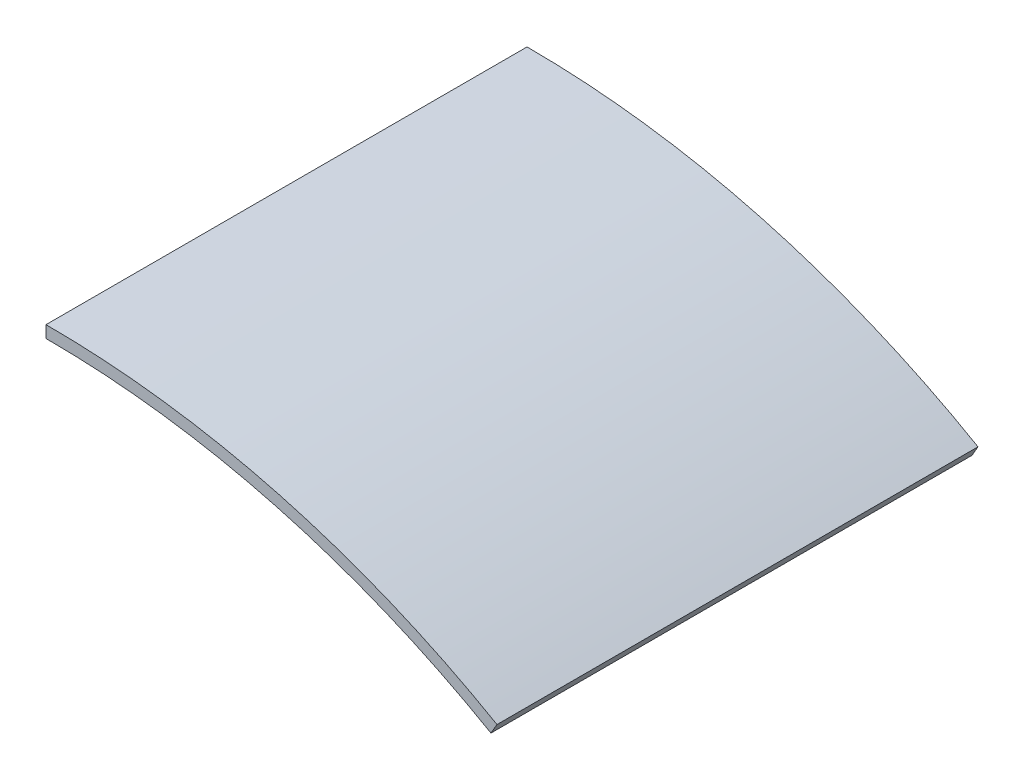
from build123d import *

# Parameters (mm, degrees)
LINEAR_AUSTRAGEN_D_NN1_DEPTH = 20


with BuildPart() as part:
    # Skizze1 → Linear-Austragen-D_nn1 (new body)
    with BuildSketch(Plane.XY):
        with BuildLine():
            ThreePointArc((18.75, 32.475952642), (9.705714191, 36.222218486), (0, 37.5))
            Line((0, 37.5), (0, 37))
            ThreePointArc((0, 37), (9.576304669, 35.739255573), (18.5, 32.04293994))
            Line((18.5, 32.04293994), (18.75, 32.475952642))
        make_face()
    extrude(amount=LINEAR_AUSTRAGEN_D_NN1_DEPTH)


solid = part.part
